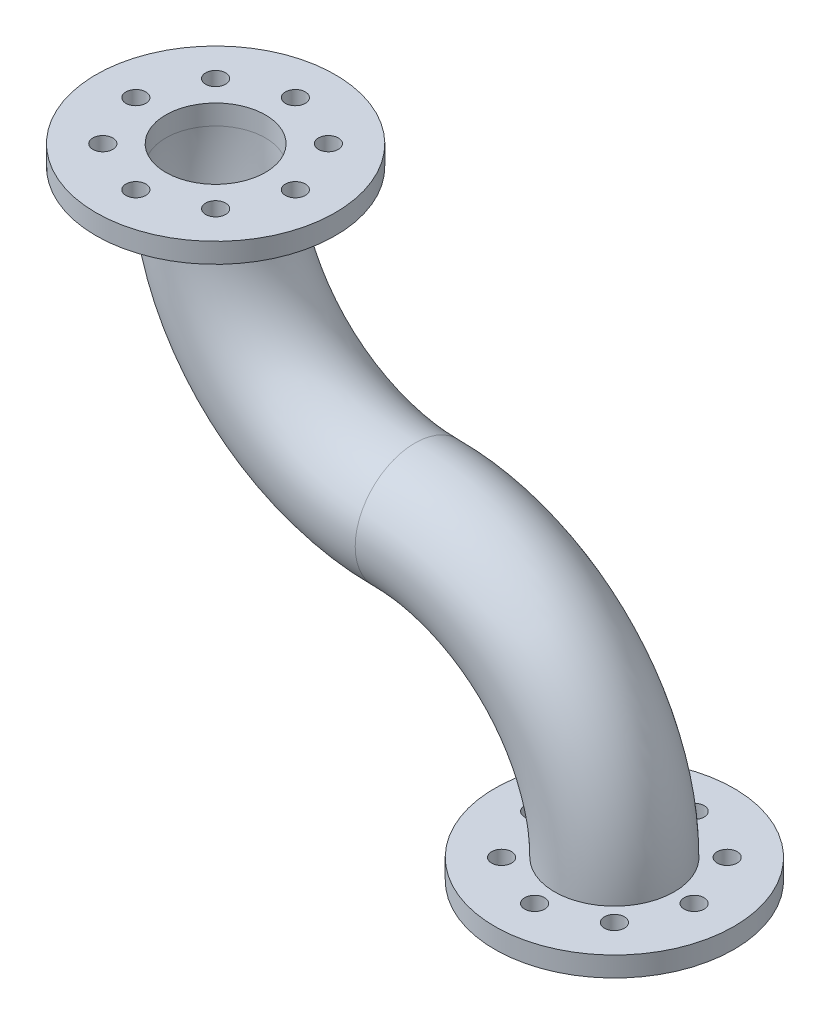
ISO-10303-21;
HEADER;
FILE_DESCRIPTION(('STEP AP214'),'2;1');
FILE_NAME('part.step','',(''),(''),'','','');
FILE_SCHEMA(('AUTOMOTIVE_DESIGN { 1 0 10303 214 1 1 1 1 }'));
ENDSEC;
DATA;
#1=APPLICATION_CONTEXT('core data for automotive mechanical design processes');
#2=APPLICATION_PROTOCOL_DEFINITION('international standard','automotive_design',2000,#1);
#3=PRODUCT_CONTEXT('',#1,'mechanical');
#4=PRODUCT('Part','Part','',(#3));
#5=PRODUCT_RELATED_PRODUCT_CATEGORY('part','',(#4));
#6=PRODUCT_DEFINITION_FORMATION('','',#4);
#7=PRODUCT_DEFINITION_CONTEXT('part definition',#1,'design');
#8=PRODUCT_DEFINITION('design','',#6,#7);
#9=PRODUCT_DEFINITION_SHAPE('','',#8);
#10=(LENGTH_UNIT() NAMED_UNIT(*) SI_UNIT(.MILLI.,.METRE.));
#11=(NAMED_UNIT(*) PLANE_ANGLE_UNIT() SI_UNIT($,.RADIAN.));
#12=(NAMED_UNIT(*) SI_UNIT($,.STERADIAN.) SOLID_ANGLE_UNIT());
#13=UNCERTAINTY_MEASURE_WITH_UNIT(LENGTH_MEASURE(1.E-05),#10,'distance_accuracy_value','');
#14=(GEOMETRIC_REPRESENTATION_CONTEXT(3) GLOBAL_UNCERTAINTY_ASSIGNED_CONTEXT((#13)) GLOBAL_UNIT_ASSIGNED_CONTEXT((#10,
#11,#12)) REPRESENTATION_CONTEXT('',''));
#15=CARTESIAN_POINT('',(0.,0.,0.));
#16=DIRECTION('',(0.,0.,1.));
#17=DIRECTION('',(1.,0.,0.));
#18=AXIS2_PLACEMENT_3D('',#15,#16,#17);
#19=CARTESIAN_POINT('',(1.74574168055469E-13,-100.,0.));
#20=DIRECTION('',(0.,0.,-1.));
#21=DIRECTION('',(-1.,0.,0.));
#22=AXIS2_PLACEMENT_3D('',#19,#20,#21);
#23=TOROIDAL_SURFACE('',#22,50.,15.);
#24=CARTESIAN_POINT('',(1.74574066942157E-13,-50.,0.));
#25=DIRECTION('',(-1.,0.,0.));
#26=DIRECTION('',(0.,0.,1.));
#27=AXIS2_PLACEMENT_3D('',#24,#25,#26);
#28=CIRCLE('',#27,15.);
#29=CARTESIAN_POINT('',(1.74574036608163E-13,-35.,0.));
#30=VERTEX_POINT('',#29);
#31=EDGE_CURVE('E36',#30,#30,#28,.T.);
#32=CARTESIAN_POINT('',(50.0000000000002,-99.9999999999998,0.));
#33=DIRECTION('',(0.,-1.,0.));
#34=DIRECTION('',(1.,0.,0.));
#35=AXIS2_PLACEMENT_3D('',#32,#33,#34);
#36=CIRCLE('',#35,15.);
#37=CARTESIAN_POINT('',(65.0000000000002,-99.9999999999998,0.));
#38=VERTEX_POINT('',#37);
#39=EDGE_CURVE('E61',#38,#38,#36,.T.);
#40=CARTESIAN_POINT('',(1.74574168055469E-13,-100.,0.));
#41=DIRECTION('',(0.,0.,-1.));
#42=DIRECTION('',(-1.,0.,0.));
#43=AXIS2_PLACEMENT_3D('',#40,#41,#42);
#44=CIRCLE('',#43,65.);
#45=EDGE_CURVE('',#30,#38,#44,.T.);
#46=ORIENTED_EDGE('',*,*,#31,.F.);
#47=ORIENTED_EDGE('',*,*,#39,.F.);
#48=ORIENTED_EDGE('',*,*,#45,.T.);
#49=ORIENTED_EDGE('',*,*,#45,.F.);
#50=EDGE_LOOP('',(#46,#48,#47,#49));
#51=FACE_BOUND('',#50,.T.);
#52=ADVANCED_FACE('F30',(#51),#23,.T.);
#53=CARTESIAN_POINT('',(1.74574168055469E-13,-100.,0.));
#54=DIRECTION('',(0.,0.,-1.));
#55=DIRECTION('',(-1.,0.,0.));
#56=AXIS2_PLACEMENT_3D('',#53,#54,#55);
#57=TOROIDAL_SURFACE('',#56,50.,12.5);
#58=CARTESIAN_POINT('',(1.74574066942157E-13,-50.,0.));
#59=DIRECTION('',(-1.,0.,0.));
#60=DIRECTION('',(0.,0.,1.));
#61=AXIS2_PLACEMENT_3D('',#58,#59,#60);
#62=CIRCLE('',#61,12.5);
#63=CARTESIAN_POINT('',(1.74574041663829E-13,-37.5,0.));
#64=VERTEX_POINT('',#63);
#65=EDGE_CURVE('E40',#64,#64,#62,.T.);
#66=CARTESIAN_POINT('',(50.0000000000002,-100.,0.));
#67=DIRECTION('',(0.,1.,0.));
#68=DIRECTION('',(0.,0.,1.));
#69=AXIS2_PLACEMENT_3D('',#66,#67,#68);
#70=CIRCLE('',#69,12.5);
#71=CARTESIAN_POINT('',(62.5000000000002,-100.,0.));
#72=VERTEX_POINT('',#71);
#73=EDGE_CURVE('E10',#72,#72,#70,.T.);
#74=CARTESIAN_POINT('',(1.74574168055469E-13,-100.,0.));
#75=DIRECTION('',(0.,0.,-1.));
#76=DIRECTION('',(-1.,0.,0.));
#77=AXIS2_PLACEMENT_3D('',#74,#75,#76);
#78=CIRCLE('',#77,62.5);
#79=EDGE_CURVE('',#64,#72,#78,.T.);
#80=ORIENTED_EDGE('',*,*,#65,.T.);
#81=ORIENTED_EDGE('',*,*,#73,.F.);
#82=ORIENTED_EDGE('',*,*,#79,.T.);
#83=ORIENTED_EDGE('',*,*,#79,.F.);
#84=EDGE_LOOP('',(#80,#82,#81,#83));
#85=FACE_BOUND('',#84,.T.);
#86=ADVANCED_FACE('F197',(#85),#57,.F.);
#87=CARTESIAN_POINT('',(0.,0.,0.));
#88=DIRECTION('',(0.,0.,-1.));
#89=DIRECTION('',(-1.,0.,0.));
#90=AXIS2_PLACEMENT_3D('',#87,#88,#89);
#91=TOROIDAL_SURFACE('',#90,50.,12.5);
#92=ORIENTED_EDGE('',*,*,#65,.F.);
#93=EDGE_LOOP('',(#92));
#94=FACE_BOUND('',#93,.T.);
#95=CARTESIAN_POINT('',(-50.,0.,0.));
#96=DIRECTION('',(0.,1.,0.));
#97=DIRECTION('',(0.,0.,1.));
#98=AXIS2_PLACEMENT_3D('',#95,#96,#97);
#99=CIRCLE('',#98,12.5);
#100=CARTESIAN_POINT('',(-50.,0.,12.5));
#101=VERTEX_POINT('',#100);
#102=EDGE_CURVE('E49',#101,#101,#99,.T.);
#103=ORIENTED_EDGE('',*,*,#102,.T.);
#104=EDGE_LOOP('',(#103));
#105=FACE_BOUND('',#104,.T.);
#106=ADVANCED_FACE('F202',(#94,#105),#91,.F.);
#107=CARTESIAN_POINT('',(0.,0.,0.));
#108=DIRECTION('',(0.,0.,-1.));
#109=DIRECTION('',(-1.,0.,0.));
#110=AXIS2_PLACEMENT_3D('',#107,#108,#109);
#111=TOROIDAL_SURFACE('',#110,50.,15.);
#112=ORIENTED_EDGE('',*,*,#31,.T.);
#113=EDGE_LOOP('',(#112));
#114=FACE_BOUND('',#113,.T.);
#115=CARTESIAN_POINT('',(-50.,0.,0.));
#116=DIRECTION('',(0.,1.,0.));
#117=DIRECTION('',(0.,0.,1.));
#118=AXIS2_PLACEMENT_3D('',#115,#116,#117);
#119=CIRCLE('',#118,15.);
#120=CARTESIAN_POINT('',(-50.,0.,15.));
#121=VERTEX_POINT('',#120);
#122=EDGE_CURVE('E44',#121,#121,#119,.T.);
#123=ORIENTED_EDGE('',*,*,#122,.F.);
#124=EDGE_LOOP('',(#123));
#125=FACE_BOUND('',#124,.T.);
#126=ADVANCED_FACE('F207',(#114,#125),#111,.T.);
#127=CARTESIAN_POINT('',(-50.,5.,0.));
#128=DIRECTION('',(0.,1.,0.));
#129=DIRECTION('',(0.,0.,1.));
#130=AXIS2_PLACEMENT_3D('',#127,#128,#129);
#131=PLANE('',#130);
#132=CARTESIAN_POINT('',(-64.1421356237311,5.,14.1421356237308));
#133=DIRECTION('',(0.,1.,0.));
#134=DIRECTION('',(0.707106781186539,0.,0.707106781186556));
#135=AXIS2_PLACEMENT_3D('',#132,#133,#134);
#136=CIRCLE('',#135,2.5);
#137=CARTESIAN_POINT('',(-62.3743686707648,5.,15.9099025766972));
#138=VERTEX_POINT('',#137);
#139=EDGE_CURVE('E118',#138,#138,#136,.T.);
#140=ORIENTED_EDGE('',*,*,#139,.F.);
#141=EDGE_LOOP('',(#140));
#142=FACE_BOUND('',#141,.T.);
#143=CARTESIAN_POINT('',(-50.0000000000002,5.,20.));
#144=DIRECTION('',(0.,1.,0.));
#145=DIRECTION('',(1.,0.,0.));
#146=AXIS2_PLACEMENT_3D('',#143,#144,#145);
#147=CIRCLE('',#146,2.5);
#148=CARTESIAN_POINT('',(-47.5000000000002,5.,20.));
#149=VERTEX_POINT('',#148);
#150=EDGE_CURVE('E112',#149,#149,#147,.T.);
#151=ORIENTED_EDGE('',*,*,#150,.F.);
#152=EDGE_LOOP('',(#151));
#153=FACE_BOUND('',#152,.T.);
#154=CARTESIAN_POINT('',(-35.8578643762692,5.,14.1421356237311));
#155=DIRECTION('',(0.,1.,0.));
#156=DIRECTION('',(0.707106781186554,0.,-0.707106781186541));
#157=AXIS2_PLACEMENT_3D('',#154,#155,#156);
#158=CIRCLE('',#157,2.5);
#159=CARTESIAN_POINT('',(-34.0900974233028,5.,12.3743686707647));
#160=VERTEX_POINT('',#159);
#161=EDGE_CURVE('E104',#160,#160,#158,.T.);
#162=ORIENTED_EDGE('',*,*,#161,.F.);
#163=EDGE_LOOP('',(#162));
#164=FACE_BOUND('',#163,.T.);
#165=CARTESIAN_POINT('',(-30.,5.,1.39659253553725E-13));
#166=DIRECTION('',(0.,1.,0.));
#167=DIRECTION('',(0.,0.,-1.));
#168=AXIS2_PLACEMENT_3D('',#165,#166,#167);
#169=CIRCLE('',#168,2.5);
#170=CARTESIAN_POINT('',(-30.,5.,-2.49999999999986));
#171=VERTEX_POINT('',#170);
#172=EDGE_CURVE('E95',#171,#171,#169,.T.);
#173=ORIENTED_EDGE('',*,*,#172,.F.);
#174=EDGE_LOOP('',(#173));
#175=FACE_BOUND('',#174,.T.);
#176=CARTESIAN_POINT('',(-35.857864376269,5.,-14.1421356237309));
#177=DIRECTION('',(0.,1.,0.));
#178=DIRECTION('',(-0.707106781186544,0.,-0.707106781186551));
#179=AXIS2_PLACEMENT_3D('',#176,#177,#178);
#180=CIRCLE('',#179,2.5);
#181=CARTESIAN_POINT('',(-37.6256313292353,5.,-15.9099025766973));
#182=VERTEX_POINT('',#181);
#183=EDGE_CURVE('E92',#182,#182,#180,.T.);
#184=ORIENTED_EDGE('',*,*,#183,.F.);
#185=EDGE_LOOP('',(#184));
#186=FACE_BOUND('',#185,.T.);
#187=CARTESIAN_POINT('',(-49.9999999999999,5.,-20.));
#188=DIRECTION('',(0.,1.,0.));
#189=DIRECTION('',(-1.,0.,0.));
#190=AXIS2_PLACEMENT_3D('',#187,#188,#189);
#191=CIRCLE('',#190,2.5);
#192=CARTESIAN_POINT('',(-52.4999999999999,5.,-20.));
#193=VERTEX_POINT('',#192);
#194=EDGE_CURVE('E88',#193,#193,#191,.T.);
#195=ORIENTED_EDGE('',*,*,#194,.F.);
#196=EDGE_LOOP('',(#195));
#197=FACE_BOUND('',#196,.T.);
#198=CARTESIAN_POINT('',(-64.1421356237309,5.,-14.142135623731));
#199=DIRECTION('',(0.,1.,0.));
#200=DIRECTION('',(-0.707106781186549,0.,0.707106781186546));
#201=AXIS2_PLACEMENT_3D('',#198,#199,#200);
#202=CIRCLE('',#201,2.5);
#203=CARTESIAN_POINT('',(-65.9099025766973,5.,-12.3743686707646));
#204=VERTEX_POINT('',#203);
#205=EDGE_CURVE('E82',#204,#204,#202,.T.);
#206=ORIENTED_EDGE('',*,*,#205,.F.);
#207=EDGE_LOOP('',(#206));
#208=FACE_BOUND('',#207,.T.);
#209=CARTESIAN_POINT('',(-70.,5.,0.));
#210=DIRECTION('',(0.,1.,0.));
#211=DIRECTION('',(0.,0.,1.));
#212=AXIS2_PLACEMENT_3D('',#209,#210,#211);
#213=CIRCLE('',#212,2.5);
#214=CARTESIAN_POINT('',(-70.,5.,2.5));
#215=VERTEX_POINT('',#214);
#216=EDGE_CURVE('E76',#215,#215,#213,.T.);
#217=ORIENTED_EDGE('',*,*,#216,.F.);
#218=EDGE_LOOP('',(#217));
#219=FACE_BOUND('',#218,.T.);
#220=CARTESIAN_POINT('',(-50.,5.,0.));
#221=DIRECTION('',(0.,1.,0.));
#222=DIRECTION('',(0.,0.,1.));
#223=AXIS2_PLACEMENT_3D('',#220,#221,#222);
#224=CIRCLE('',#223,30.);
#225=CARTESIAN_POINT('',(-50.,5.,30.));
#226=VERTEX_POINT('',#225);
#227=EDGE_CURVE('E52',#226,#226,#224,.T.);
#228=ORIENTED_EDGE('',*,*,#227,.T.);
#229=EDGE_LOOP('',(#228));
#230=FACE_BOUND('',#229,.T.);
#231=CARTESIAN_POINT('',(-50.,5.,0.));
#232=DIRECTION('',(0.,1.,0.));
#233=DIRECTION('',(0.,0.,1.));
#234=AXIS2_PLACEMENT_3D('',#231,#232,#233);
#235=CIRCLE('',#234,12.5);
#236=CARTESIAN_POINT('',(-50.,5.,12.5));
#237=VERTEX_POINT('',#236);
#238=EDGE_CURVE('E56',#237,#237,#235,.T.);
#239=ORIENTED_EDGE('',*,*,#238,.F.);
#240=EDGE_LOOP('',(#239));
#241=FACE_BOUND('',#240,.T.);
#242=ADVANCED_FACE('F213',(#142,#153,#164,#175,#186,#197,#208,#219,#230,#241),#131,.T.);
#243=CARTESIAN_POINT('',(-50.,0.,0.));
#244=DIRECTION('',(0.,1.,0.));
#245=DIRECTION('',(0.,0.,1.));
#246=AXIS2_PLACEMENT_3D('',#243,#244,#245);
#247=PLANE('',#246);
#248=CARTESIAN_POINT('',(-64.1421356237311,0.,14.1421356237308));
#249=DIRECTION('',(0.,1.,0.));
#250=DIRECTION('',(0.,0.,1.));
#251=AXIS2_PLACEMENT_3D('',#248,#249,#250);
#252=CIRCLE('',#251,2.5);
#253=CARTESIAN_POINT('',(-64.1421356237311,0.,16.6421356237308));
#254=VERTEX_POINT('',#253);
#255=EDGE_CURVE('E115',#254,#254,#252,.F.);
#256=ORIENTED_EDGE('',*,*,#255,.F.);
#257=EDGE_LOOP('',(#256));
#258=FACE_BOUND('',#257,.T.);
#259=CARTESIAN_POINT('',(-50.0000000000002,0.,20.));
#260=DIRECTION('',(0.,1.,0.));
#261=DIRECTION('',(0.,0.,1.));
#262=AXIS2_PLACEMENT_3D('',#259,#260,#261);
#263=CIRCLE('',#262,2.5);
#264=CARTESIAN_POINT('',(-50.0000000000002,0.,22.5));
#265=VERTEX_POINT('',#264);
#266=EDGE_CURVE('E107',#265,#265,#263,.F.);
#267=ORIENTED_EDGE('',*,*,#266,.F.);
#268=EDGE_LOOP('',(#267));
#269=FACE_BOUND('',#268,.T.);
#270=CARTESIAN_POINT('',(-35.8578643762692,0.,14.1421356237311));
#271=DIRECTION('',(0.,1.,0.));
#272=DIRECTION('',(0.,0.,1.));
#273=AXIS2_PLACEMENT_3D('',#270,#271,#272);
#274=CIRCLE('',#273,2.5);
#275=CARTESIAN_POINT('',(-35.8578643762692,0.,16.6421356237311));
#276=VERTEX_POINT('',#275);
#277=EDGE_CURVE('E103',#276,#276,#274,.F.);
#278=ORIENTED_EDGE('',*,*,#277,.F.);
#279=EDGE_LOOP('',(#278));
#280=FACE_BOUND('',#279,.T.);
#281=CARTESIAN_POINT('',(-30.,0.,1.39659253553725E-13));
#282=DIRECTION('',(0.,1.,0.));
#283=DIRECTION('',(0.,0.,1.));
#284=AXIS2_PLACEMENT_3D('',#281,#282,#283);
#285=CIRCLE('',#284,2.5);
#286=CARTESIAN_POINT('',(-30.,0.,2.50000000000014));
#287=VERTEX_POINT('',#286);
#288=EDGE_CURVE('E100',#287,#287,#285,.F.);
#289=ORIENTED_EDGE('',*,*,#288,.F.);
#290=EDGE_LOOP('',(#289));
#291=FACE_BOUND('',#290,.T.);
#292=CARTESIAN_POINT('',(-35.857864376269,0.,-14.1421356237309));
#293=DIRECTION('',(0.,1.,0.));
#294=DIRECTION('',(0.,0.,1.));
#295=AXIS2_PLACEMENT_3D('',#292,#293,#294);
#296=CIRCLE('',#295,2.5);
#297=CARTESIAN_POINT('',(-35.857864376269,0.,-11.6421356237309));
#298=VERTEX_POINT('',#297);
#299=EDGE_CURVE('E91',#298,#298,#296,.F.);
#300=ORIENTED_EDGE('',*,*,#299,.F.);
#301=EDGE_LOOP('',(#300));
#302=FACE_BOUND('',#301,.T.);
#303=CARTESIAN_POINT('',(-49.9999999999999,0.,-20.));
#304=DIRECTION('',(0.,1.,0.));
#305=DIRECTION('',(0.,0.,1.));
#306=AXIS2_PLACEMENT_3D('',#303,#304,#305);
#307=CIRCLE('',#306,2.5);
#308=CARTESIAN_POINT('',(-49.9999999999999,0.,-17.5));
#309=VERTEX_POINT('',#308);
#310=EDGE_CURVE('E85',#309,#309,#307,.F.);
#311=ORIENTED_EDGE('',*,*,#310,.F.);
#312=EDGE_LOOP('',(#311));
#313=FACE_BOUND('',#312,.T.);
#314=CARTESIAN_POINT('',(-64.1421356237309,0.,-14.142135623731));
#315=DIRECTION('',(0.,1.,0.));
#316=DIRECTION('',(0.,0.,1.));
#317=AXIS2_PLACEMENT_3D('',#314,#315,#316);
#318=CIRCLE('',#317,2.5);
#319=CARTESIAN_POINT('',(-64.1421356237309,0.,-11.642135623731));
#320=VERTEX_POINT('',#319);
#321=EDGE_CURVE('E79',#320,#320,#318,.F.);
#322=ORIENTED_EDGE('',*,*,#321,.F.);
#323=EDGE_LOOP('',(#322));
#324=FACE_BOUND('',#323,.T.);
#325=CARTESIAN_POINT('',(-70.,0.,0.));
#326=DIRECTION('',(0.,1.,0.));
#327=DIRECTION('',(0.,0.,1.));
#328=AXIS2_PLACEMENT_3D('',#325,#326,#327);
#329=CIRCLE('',#328,2.5);
#330=CARTESIAN_POINT('',(-70.,0.,2.5));
#331=VERTEX_POINT('',#330);
#332=EDGE_CURVE('E73',#331,#331,#329,.F.);
#333=ORIENTED_EDGE('',*,*,#332,.F.);
#334=EDGE_LOOP('',(#333));
#335=FACE_BOUND('',#334,.T.);
#336=ORIENTED_EDGE('',*,*,#122,.T.);
#337=EDGE_LOOP('',(#336));
#338=FACE_BOUND('',#337,.T.);
#339=CARTESIAN_POINT('',(-50.,0.,0.));
#340=DIRECTION('',(0.,1.,0.));
#341=DIRECTION('',(0.,0.,1.));
#342=AXIS2_PLACEMENT_3D('',#339,#340,#341);
#343=CIRCLE('',#342,30.);
#344=CARTESIAN_POINT('',(-50.,0.,30.));
#345=VERTEX_POINT('',#344);
#346=EDGE_CURVE('E53',#345,#345,#343,.T.);
#347=ORIENTED_EDGE('',*,*,#346,.F.);
#348=EDGE_LOOP('',(#347));
#349=FACE_BOUND('',#348,.T.);
#350=ADVANCED_FACE('F218',(#258,#269,#280,#291,#302,#313,#324,#335,#338,#349),#247,.F.);
#351=CARTESIAN_POINT('',(-50.,5.,0.));
#352=DIRECTION('',(0.,-1.,0.));
#353=DIRECTION('',(0.,0.,-1.));
#354=AXIS2_PLACEMENT_3D('',#351,#352,#353);
#355=CYLINDRICAL_SURFACE('',#354,30.);
#356=ORIENTED_EDGE('',*,*,#227,.F.);
#357=EDGE_LOOP('',(#356));
#358=FACE_BOUND('',#357,.T.);
#359=ORIENTED_EDGE('',*,*,#346,.T.);
#360=EDGE_LOOP('',(#359));
#361=FACE_BOUND('',#360,.T.);
#362=ADVANCED_FACE('F215',(#358,#361),#355,.T.);
#363=CARTESIAN_POINT('',(-50.,5.,0.));
#364=DIRECTION('',(0.,-1.,0.));
#365=DIRECTION('',(0.,0.,-1.));
#366=AXIS2_PLACEMENT_3D('',#363,#364,#365);
#367=CYLINDRICAL_SURFACE('',#366,12.5);
#368=ORIENTED_EDGE('',*,*,#238,.T.);
#369=EDGE_LOOP('',(#368));
#370=FACE_BOUND('',#369,.T.);
#371=ORIENTED_EDGE('',*,*,#102,.F.);
#372=EDGE_LOOP('',(#371));
#373=FACE_BOUND('',#372,.T.);
#374=ADVANCED_FACE('F176',(#370,#373),#367,.F.);
#375=CARTESIAN_POINT('',(50.0000000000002,-99.9999999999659,0.));
#376=DIRECTION('',(0.,-1.,0.));
#377=DIRECTION('',(1.,0.,0.));
#378=AXIS2_PLACEMENT_3D('',#375,#376,#377);
#379=PLANE('',#378);
#380=CARTESIAN_POINT('',(64.1421356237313,-100.000000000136,14.1421356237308));
#381=DIRECTION('',(0.,1.,0.));
#382=DIRECTION('',(-0.707106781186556,0.,-0.707106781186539));
#383=AXIS2_PLACEMENT_3D('',#380,#381,#382);
#384=CIRCLE('',#383,2.50000000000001);
#385=CARTESIAN_POINT('',(62.3743686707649,-100.000000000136,12.3743686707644));
#386=VERTEX_POINT('',#385);
#387=EDGE_CURVE('E161',#386,#386,#384,.T.);
#388=ORIENTED_EDGE('',*,*,#387,.F.);
#389=EDGE_LOOP('',(#388));
#390=FACE_BOUND('',#389,.T.);
#391=CARTESIAN_POINT('',(50.0000000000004,-100.000000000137,20.));
#392=DIRECTION('',(0.,1.,0.));
#393=DIRECTION('',(0.,0.,-1.));
#394=AXIS2_PLACEMENT_3D('',#391,#392,#393);
#395=CIRCLE('',#394,2.50000000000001);
#396=CARTESIAN_POINT('',(47.5000000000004,-100.000000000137,20.));
#397=VERTEX_POINT('',#396);
#398=EDGE_CURVE('E155',#397,#397,#395,.T.);
#399=ORIENTED_EDGE('',*,*,#398,.F.);
#400=EDGE_LOOP('',(#399));
#401=FACE_BOUND('',#400,.T.);
#402=CARTESIAN_POINT('',(35.8578643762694,-100.000000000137,14.1421356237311));
#403=DIRECTION('',(0.,1.,0.));
#404=DIRECTION('',(0.707106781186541,0.,-0.707106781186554));
#405=AXIS2_PLACEMENT_3D('',#402,#403,#404);
#406=CIRCLE('',#405,2.50000000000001);
#407=CARTESIAN_POINT('',(37.6256313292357,-100.000000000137,12.3743686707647));
#408=VERTEX_POINT('',#407);
#409=EDGE_CURVE('E149',#408,#408,#406,.T.);
#410=ORIENTED_EDGE('',*,*,#409,.F.);
#411=EDGE_LOOP('',(#410));
#412=FACE_BOUND('',#411,.T.);
#413=CARTESIAN_POINT('',(30.0000000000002,-100.000000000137,1.39659253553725E-13));
#414=DIRECTION('',(0.,1.,0.));
#415=DIRECTION('',(1.,0.,0.));
#416=AXIS2_PLACEMENT_3D('',#413,#414,#415);
#417=CIRCLE('',#416,2.50000000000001);
#418=CARTESIAN_POINT('',(32.5000000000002,-100.000000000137,1.2220184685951E-13));
#419=VERTEX_POINT('',#418);
#420=EDGE_CURVE('E143',#419,#419,#417,.T.);
#421=ORIENTED_EDGE('',*,*,#420,.F.);
#422=EDGE_LOOP('',(#421));
#423=FACE_BOUND('',#422,.T.);
#424=CARTESIAN_POINT('',(35.8578643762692,-100.000000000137,-14.1421356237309));
#425=DIRECTION('',(0.,1.,0.));
#426=DIRECTION('',(0.707106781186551,0.,0.707106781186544));
#427=AXIS2_PLACEMENT_3D('',#424,#425,#426);
#428=CIRCLE('',#427,2.50000000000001);
#429=CARTESIAN_POINT('',(37.6256313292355,-100.000000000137,-12.3743686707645));
#430=VERTEX_POINT('',#429);
#431=EDGE_CURVE('E137',#430,#430,#428,.T.);
#432=ORIENTED_EDGE('',*,*,#431,.F.);
#433=EDGE_LOOP('',(#432));
#434=FACE_BOUND('',#433,.T.);
#435=CARTESIAN_POINT('',(50.0000000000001,-100.000000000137,-20.));
#436=DIRECTION('',(0.,1.,0.));
#437=DIRECTION('',(0.,0.,1.));
#438=AXIS2_PLACEMENT_3D('',#435,#436,#437);
#439=CIRCLE('',#438,2.50000000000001);
#440=CARTESIAN_POINT('',(47.5000000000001,-100.000000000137,-20.));
#441=VERTEX_POINT('',#440);
#442=EDGE_CURVE('E131',#441,#441,#439,.T.);
#443=ORIENTED_EDGE('',*,*,#442,.F.);
#444=EDGE_LOOP('',(#443));
#445=FACE_BOUND('',#444,.T.);
#446=CARTESIAN_POINT('',(64.1421356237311,-100.000000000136,-14.142135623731));
#447=DIRECTION('',(0.,1.,0.));
#448=DIRECTION('',(-0.707106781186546,0.,0.707106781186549));
#449=AXIS2_PLACEMENT_3D('',#446,#447,#448);
#450=CIRCLE('',#449,2.50000000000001);
#451=CARTESIAN_POINT('',(62.3743686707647,-100.000000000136,-12.3743686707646));
#452=VERTEX_POINT('',#451);
#453=EDGE_CURVE('E125',#452,#452,#450,.T.);
#454=ORIENTED_EDGE('',*,*,#453,.F.);
#455=EDGE_LOOP('',(#454));
#456=FACE_BOUND('',#455,.T.);
#457=CARTESIAN_POINT('',(70.0000000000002,-100.000000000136,0.));
#458=DIRECTION('',(0.,1.,0.));
#459=DIRECTION('',(-1.,0.,0.));
#460=AXIS2_PLACEMENT_3D('',#457,#458,#459);
#461=CIRCLE('',#460,2.50000000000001);
#462=CARTESIAN_POINT('',(67.5000000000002,-100.000000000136,0.));
#463=VERTEX_POINT('',#462);
#464=EDGE_CURVE('E121',#463,#463,#461,.T.);
#465=ORIENTED_EDGE('',*,*,#464,.F.);
#466=EDGE_LOOP('',(#465));
#467=FACE_BOUND('',#466,.T.);
#468=CARTESIAN_POINT('',(50.0000000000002,-99.9999999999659,0.));
#469=DIRECTION('',(0.,-1.,0.));
#470=DIRECTION('',(1.,0.,0.));
#471=AXIS2_PLACEMENT_3D('',#468,#469,#470);
#472=CIRCLE('',#471,30.);
#473=CARTESIAN_POINT('',(80.0000000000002,-99.9999999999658,0.));
#474=VERTEX_POINT('',#473);
#475=EDGE_CURVE('E65',#474,#474,#472,.T.);
#476=ORIENTED_EDGE('',*,*,#475,.F.);
#477=EDGE_LOOP('',(#476));
#478=FACE_BOUND('',#477,.T.);
#479=ORIENTED_EDGE('',*,*,#39,.T.);
#480=EDGE_LOOP('',(#479));
#481=FACE_BOUND('',#480,.T.);
#482=ADVANCED_FACE('F172',(#390,#401,#412,#423,#434,#445,#456,#467,#478,#481),#379,.F.);
#483=CARTESIAN_POINT('',(50.0000000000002,-104.999999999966,0.));
#484=DIRECTION('',(0.,-1.,0.));
#485=DIRECTION('',(1.,0.,0.));
#486=AXIS2_PLACEMENT_3D('',#483,#484,#485);
#487=PLANE('',#486);
#488=CARTESIAN_POINT('',(64.1421356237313,-104.999999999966,14.1421356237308));
#489=DIRECTION('',(0.,-1.,0.));
#490=DIRECTION('',(1.,0.,0.));
#491=AXIS2_PLACEMENT_3D('',#488,#489,#490);
#492=CIRCLE('',#491,2.50000000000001);
#493=CARTESIAN_POINT('',(66.6421356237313,-104.999999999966,14.1421356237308));
#494=VERTEX_POINT('',#493);
#495=EDGE_CURVE('E164',#494,#494,#492,.F.);
#496=ORIENTED_EDGE('',*,*,#495,.T.);
#497=EDGE_LOOP('',(#496));
#498=FACE_BOUND('',#497,.T.);
#499=CARTESIAN_POINT('',(50.0000000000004,-104.999999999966,20.));
#500=DIRECTION('',(0.,-1.,0.));
#501=DIRECTION('',(1.,0.,0.));
#502=AXIS2_PLACEMENT_3D('',#499,#500,#501);
#503=CIRCLE('',#502,2.50000000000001);
#504=CARTESIAN_POINT('',(47.5000000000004,-104.999999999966,20.));
#505=VERTEX_POINT('',#504);
#506=EDGE_CURVE('E158',#505,#505,#503,.F.);
#507=ORIENTED_EDGE('',*,*,#506,.T.);
#508=EDGE_LOOP('',(#507));
#509=FACE_BOUND('',#508,.T.);
#510=CARTESIAN_POINT('',(35.8578643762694,-104.999999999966,14.1421356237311));
#511=DIRECTION('',(0.,-1.,0.));
#512=DIRECTION('',(1.,0.,0.));
#513=AXIS2_PLACEMENT_3D('',#510,#511,#512);
#514=CIRCLE('',#513,2.50000000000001);
#515=CARTESIAN_POINT('',(38.3578643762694,-104.999999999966,14.1421356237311));
#516=VERTEX_POINT('',#515);
#517=EDGE_CURVE('E152',#516,#516,#514,.F.);
#518=ORIENTED_EDGE('',*,*,#517,.T.);
#519=EDGE_LOOP('',(#518));
#520=FACE_BOUND('',#519,.T.);
#521=CARTESIAN_POINT('',(30.0000000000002,-104.999999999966,1.39659253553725E-13));
#522=DIRECTION('',(0.,-1.,0.));
#523=DIRECTION('',(1.,0.,0.));
#524=AXIS2_PLACEMENT_3D('',#521,#522,#523);
#525=CIRCLE('',#524,2.50000000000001);
#526=CARTESIAN_POINT('',(32.5000000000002,-104.999999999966,1.39659253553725E-13));
#527=VERTEX_POINT('',#526);
#528=EDGE_CURVE('E146',#527,#527,#525,.F.);
#529=ORIENTED_EDGE('',*,*,#528,.T.);
#530=EDGE_LOOP('',(#529));
#531=FACE_BOUND('',#530,.T.);
#532=CARTESIAN_POINT('',(35.8578643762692,-104.999999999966,-14.1421356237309));
#533=DIRECTION('',(0.,-1.,0.));
#534=DIRECTION('',(1.,0.,0.));
#535=AXIS2_PLACEMENT_3D('',#532,#533,#534);
#536=CIRCLE('',#535,2.50000000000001);
#537=CARTESIAN_POINT('',(38.3578643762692,-104.999999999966,-14.1421356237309));
#538=VERTEX_POINT('',#537);
#539=EDGE_CURVE('E140',#538,#538,#536,.F.);
#540=ORIENTED_EDGE('',*,*,#539,.T.);
#541=EDGE_LOOP('',(#540));
#542=FACE_BOUND('',#541,.T.);
#543=CARTESIAN_POINT('',(50.0000000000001,-104.999999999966,-20.));
#544=DIRECTION('',(0.,-1.,0.));
#545=DIRECTION('',(1.,0.,0.));
#546=AXIS2_PLACEMENT_3D('',#543,#544,#545);
#547=CIRCLE('',#546,2.50000000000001);
#548=CARTESIAN_POINT('',(47.5000000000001,-104.999999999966,-20.));
#549=VERTEX_POINT('',#548);
#550=EDGE_CURVE('E134',#549,#549,#547,.F.);
#551=ORIENTED_EDGE('',*,*,#550,.T.);
#552=EDGE_LOOP('',(#551));
#553=FACE_BOUND('',#552,.T.);
#554=CARTESIAN_POINT('',(64.1421356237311,-104.999999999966,-14.142135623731));
#555=DIRECTION('',(0.,-1.,0.));
#556=DIRECTION('',(1.,0.,0.));
#557=AXIS2_PLACEMENT_3D('',#554,#555,#556);
#558=CIRCLE('',#557,2.50000000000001);
#559=CARTESIAN_POINT('',(66.6421356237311,-104.999999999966,-14.142135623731));
#560=VERTEX_POINT('',#559);
#561=EDGE_CURVE('E128',#560,#560,#558,.F.);
#562=ORIENTED_EDGE('',*,*,#561,.T.);
#563=EDGE_LOOP('',(#562));
#564=FACE_BOUND('',#563,.T.);
#565=CARTESIAN_POINT('',(70.0000000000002,-104.999999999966,0.));
#566=DIRECTION('',(0.,-1.,0.));
#567=DIRECTION('',(1.,0.,0.));
#568=AXIS2_PLACEMENT_3D('',#565,#566,#567);
#569=CIRCLE('',#568,2.50000000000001);
#570=CARTESIAN_POINT('',(72.5000000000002,-104.999999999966,0.));
#571=VERTEX_POINT('',#570);
#572=EDGE_CURVE('E122',#571,#571,#569,.F.);
#573=ORIENTED_EDGE('',*,*,#572,.T.);
#574=EDGE_LOOP('',(#573));
#575=FACE_BOUND('',#574,.T.);
#576=CARTESIAN_POINT('',(50.0000000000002,-104.999999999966,0.));
#577=DIRECTION('',(0.,-1.,0.));
#578=DIRECTION('',(1.,0.,0.));
#579=AXIS2_PLACEMENT_3D('',#576,#577,#578);
#580=CIRCLE('',#579,30.);
#581=CARTESIAN_POINT('',(80.0000000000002,-104.999999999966,0.));
#582=VERTEX_POINT('',#581);
#583=EDGE_CURVE('E64',#582,#582,#580,.T.);
#584=ORIENTED_EDGE('',*,*,#583,.T.);
#585=EDGE_LOOP('',(#584));
#586=FACE_BOUND('',#585,.T.);
#587=CARTESIAN_POINT('',(50.0000000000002,-104.999999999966,0.));
#588=DIRECTION('',(0.,-1.,0.));
#589=DIRECTION('',(1.,0.,0.));
#590=AXIS2_PLACEMENT_3D('',#587,#588,#589);
#591=CIRCLE('',#590,12.5);
#592=CARTESIAN_POINT('',(62.5000000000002,-104.999999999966,0.));
#593=VERTEX_POINT('',#592);
#594=EDGE_CURVE('E68',#593,#593,#591,.T.);
#595=ORIENTED_EDGE('',*,*,#594,.F.);
#596=EDGE_LOOP('',(#595));
#597=FACE_BOUND('',#596,.T.);
#598=ADVANCED_FACE('F175',(#498,#509,#520,#531,#542,#553,#564,#575,#586,#597),#487,.T.);
#599=CARTESIAN_POINT('',(50.0000000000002,-104.999999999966,0.));
#600=DIRECTION('',(0.,1.,0.));
#601=DIRECTION('',(-1.,0.,0.));
#602=AXIS2_PLACEMENT_3D('',#599,#600,#601);
#603=CYLINDRICAL_SURFACE('',#602,30.);
#604=ORIENTED_EDGE('',*,*,#583,.F.);
#605=EDGE_LOOP('',(#604));
#606=FACE_BOUND('',#605,.T.);
#607=ORIENTED_EDGE('',*,*,#475,.T.);
#608=EDGE_LOOP('',(#607));
#609=FACE_BOUND('',#608,.T.);
#610=ADVANCED_FACE('F229',(#606,#609),#603,.T.);
#611=CARTESIAN_POINT('',(50.0000000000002,-104.999999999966,0.));
#612=DIRECTION('',(0.,1.,0.));
#613=DIRECTION('',(-1.,0.,0.));
#614=AXIS2_PLACEMENT_3D('',#611,#612,#613);
#615=CYLINDRICAL_SURFACE('',#614,12.5);
#616=ORIENTED_EDGE('',*,*,#594,.T.);
#617=EDGE_LOOP('',(#616));
#618=FACE_BOUND('',#617,.T.);
#619=ORIENTED_EDGE('',*,*,#73,.T.);
#620=EDGE_LOOP('',(#619));
#621=FACE_BOUND('',#620,.T.);
#622=ADVANCED_FACE('F231',(#618,#621),#615,.F.);
#623=CARTESIAN_POINT('',(-70.,-105.000999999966,0.));
#624=DIRECTION('',(0.,1.,0.));
#625=DIRECTION('',(0.,0.,1.));
#626=AXIS2_PLACEMENT_3D('',#623,#624,#625);
#627=CYLINDRICAL_SURFACE('',#626,2.5);
#628=ORIENTED_EDGE('',*,*,#216,.T.);
#629=EDGE_LOOP('',(#628));
#630=FACE_BOUND('',#629,.T.);
#631=ORIENTED_EDGE('',*,*,#332,.T.);
#632=EDGE_LOOP('',(#631));
#633=FACE_BOUND('',#632,.T.);
#634=ADVANCED_FACE('F239',(#630,#633),#627,.F.);
#635=CARTESIAN_POINT('',(-64.1421356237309,-105.000999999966,-14.142135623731));
#636=DIRECTION('',(0.,1.,0.));
#637=DIRECTION('',(0.,0.,1.));
#638=AXIS2_PLACEMENT_3D('',#635,#636,#637);
#639=CYLINDRICAL_SURFACE('',#638,2.5);
#640=ORIENTED_EDGE('',*,*,#205,.T.);
#641=EDGE_LOOP('',(#640));
#642=FACE_BOUND('',#641,.T.);
#643=ORIENTED_EDGE('',*,*,#321,.T.);
#644=EDGE_LOOP('',(#643));
#645=FACE_BOUND('',#644,.T.);
#646=ADVANCED_FACE('F243',(#642,#645),#639,.F.);
#647=CARTESIAN_POINT('',(-49.9999999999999,-105.000999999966,-20.));
#648=DIRECTION('',(0.,1.,0.));
#649=DIRECTION('',(0.,0.,1.));
#650=AXIS2_PLACEMENT_3D('',#647,#648,#649);
#651=CYLINDRICAL_SURFACE('',#650,2.5);
#652=ORIENTED_EDGE('',*,*,#194,.T.);
#653=EDGE_LOOP('',(#652));
#654=FACE_BOUND('',#653,.T.);
#655=ORIENTED_EDGE('',*,*,#310,.T.);
#656=EDGE_LOOP('',(#655));
#657=FACE_BOUND('',#656,.T.);
#658=ADVANCED_FACE('F247',(#654,#657),#651,.F.);
#659=CARTESIAN_POINT('',(-35.857864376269,-105.000999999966,-14.1421356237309));
#660=DIRECTION('',(0.,1.,0.));
#661=DIRECTION('',(0.,0.,1.));
#662=AXIS2_PLACEMENT_3D('',#659,#660,#661);
#663=CYLINDRICAL_SURFACE('',#662,2.5);
#664=ORIENTED_EDGE('',*,*,#183,.T.);
#665=EDGE_LOOP('',(#664));
#666=FACE_BOUND('',#665,.T.);
#667=ORIENTED_EDGE('',*,*,#299,.T.);
#668=EDGE_LOOP('',(#667));
#669=FACE_BOUND('',#668,.T.);
#670=ADVANCED_FACE('F251',(#666,#669),#663,.F.);
#671=CARTESIAN_POINT('',(-30.,-105.000999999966,1.39659253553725E-13));
#672=DIRECTION('',(0.,1.,0.));
#673=DIRECTION('',(0.,0.,1.));
#674=AXIS2_PLACEMENT_3D('',#671,#672,#673);
#675=CYLINDRICAL_SURFACE('',#674,2.5);
#676=ORIENTED_EDGE('',*,*,#172,.T.);
#677=EDGE_LOOP('',(#676));
#678=FACE_BOUND('',#677,.T.);
#679=ORIENTED_EDGE('',*,*,#288,.T.);
#680=EDGE_LOOP('',(#679));
#681=FACE_BOUND('',#680,.T.);
#682=ADVANCED_FACE('F255',(#678,#681),#675,.F.);
#683=CARTESIAN_POINT('',(-35.8578643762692,-105.000999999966,14.1421356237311));
#684=DIRECTION('',(0.,1.,0.));
#685=DIRECTION('',(0.,0.,1.));
#686=AXIS2_PLACEMENT_3D('',#683,#684,#685);
#687=CYLINDRICAL_SURFACE('',#686,2.5);
#688=ORIENTED_EDGE('',*,*,#161,.T.);
#689=EDGE_LOOP('',(#688));
#690=FACE_BOUND('',#689,.T.);
#691=ORIENTED_EDGE('',*,*,#277,.T.);
#692=EDGE_LOOP('',(#691));
#693=FACE_BOUND('',#692,.T.);
#694=ADVANCED_FACE('F259',(#690,#693),#687,.F.);
#695=CARTESIAN_POINT('',(-50.0000000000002,-105.000999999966,20.));
#696=DIRECTION('',(0.,1.,0.));
#697=DIRECTION('',(0.,0.,1.));
#698=AXIS2_PLACEMENT_3D('',#695,#696,#697);
#699=CYLINDRICAL_SURFACE('',#698,2.5);
#700=ORIENTED_EDGE('',*,*,#150,.T.);
#701=EDGE_LOOP('',(#700));
#702=FACE_BOUND('',#701,.T.);
#703=ORIENTED_EDGE('',*,*,#266,.T.);
#704=EDGE_LOOP('',(#703));
#705=FACE_BOUND('',#704,.T.);
#706=ADVANCED_FACE('F263',(#702,#705),#699,.F.);
#707=CARTESIAN_POINT('',(-64.1421356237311,-105.000999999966,14.1421356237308));
#708=DIRECTION('',(0.,1.,0.));
#709=DIRECTION('',(0.,0.,1.));
#710=AXIS2_PLACEMENT_3D('',#707,#708,#709);
#711=CYLINDRICAL_SURFACE('',#710,2.5);
#712=ORIENTED_EDGE('',*,*,#139,.T.);
#713=EDGE_LOOP('',(#712));
#714=FACE_BOUND('',#713,.T.);
#715=ORIENTED_EDGE('',*,*,#255,.T.);
#716=EDGE_LOOP('',(#715));
#717=FACE_BOUND('',#716,.T.);
#718=ADVANCED_FACE('F267',(#714,#717),#711,.F.);
#719=CARTESIAN_POINT('',(70.0000000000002,-105.000999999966,0.));
#720=DIRECTION('',(0.,1.,0.));
#721=DIRECTION('',(-1.,0.,0.));
#722=AXIS2_PLACEMENT_3D('',#719,#720,#721);
#723=CYLINDRICAL_SURFACE('',#722,2.50000000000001);
#724=ORIENTED_EDGE('',*,*,#572,.F.);
#725=EDGE_LOOP('',(#724));
#726=FACE_BOUND('',#725,.T.);
#727=ORIENTED_EDGE('',*,*,#464,.T.);
#728=EDGE_LOOP('',(#727));
#729=FACE_BOUND('',#728,.T.);
#730=ADVANCED_FACE('F271',(#726,#729),#723,.F.);
#731=CARTESIAN_POINT('',(64.1421356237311,-105.000999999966,-14.142135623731));
#732=DIRECTION('',(0.,1.,0.));
#733=DIRECTION('',(-1.,0.,0.));
#734=AXIS2_PLACEMENT_3D('',#731,#732,#733);
#735=CYLINDRICAL_SURFACE('',#734,2.50000000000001);
#736=ORIENTED_EDGE('',*,*,#561,.F.);
#737=EDGE_LOOP('',(#736));
#738=FACE_BOUND('',#737,.T.);
#739=ORIENTED_EDGE('',*,*,#453,.T.);
#740=EDGE_LOOP('',(#739));
#741=FACE_BOUND('',#740,.T.);
#742=ADVANCED_FACE('F275',(#738,#741),#735,.F.);
#743=CARTESIAN_POINT('',(50.0000000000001,-105.000999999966,-20.));
#744=DIRECTION('',(0.,1.,0.));
#745=DIRECTION('',(-1.,0.,0.));
#746=AXIS2_PLACEMENT_3D('',#743,#744,#745);
#747=CYLINDRICAL_SURFACE('',#746,2.50000000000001);
#748=CARTESIAN_POINT('',(47.5000000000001,-104.999999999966,-20.));
#749=CARTESIAN_POINT('',(47.5000000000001,-104.947916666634,-20.));
#750=CARTESIAN_POINT('',(47.5000000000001,-104.895833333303,-20.));
#751=CARTESIAN_POINT('',(47.5000000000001,-104.79166666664,-20.));
#752=CARTESIAN_POINT('',(47.5000000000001,-104.739583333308,-20.));
#753=CARTESIAN_POINT('',(47.5000000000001,-104.635416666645,-20.));
#754=CARTESIAN_POINT('',(47.5000000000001,-104.583333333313,-20.));
#755=CARTESIAN_POINT('',(47.5000000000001,-104.47916666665,-20.));
#756=CARTESIAN_POINT('',(47.5000000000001,-104.427083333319,-20.));
#757=CARTESIAN_POINT('',(47.5000000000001,-104.322916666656,-20.));
#758=CARTESIAN_POINT('',(47.5000000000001,-104.270833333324,-20.));
#759=CARTESIAN_POINT('',(47.5000000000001,-104.166666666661,-20.));
#760=CARTESIAN_POINT('',(47.5000000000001,-104.114583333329,-20.));
#761=CARTESIAN_POINT('',(47.5000000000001,-104.010416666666,-20.));
#762=CARTESIAN_POINT('',(47.5000000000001,-103.958333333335,-20.));
#763=CARTESIAN_POINT('',(47.5000000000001,-103.854166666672,-20.));
#764=CARTESIAN_POINT('',(47.5000000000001,-103.80208333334,-20.));
#765=CARTESIAN_POINT('',(47.5000000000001,-103.697916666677,-20.));
#766=CARTESIAN_POINT('',(47.5000000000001,-103.645833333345,-20.));
#767=CARTESIAN_POINT('',(47.5000000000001,-103.541666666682,-20.));
#768=CARTESIAN_POINT('',(47.5000000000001,-103.489583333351,-20.));
#769=CARTESIAN_POINT('',(47.5000000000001,-103.385416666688,-20.));
#770=CARTESIAN_POINT('',(47.5000000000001,-103.333333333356,-20.));
#771=CARTESIAN_POINT('',(47.5000000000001,-103.229166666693,-20.));
#772=CARTESIAN_POINT('',(47.5000000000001,-103.177083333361,-20.));
#773=CARTESIAN_POINT('',(47.5000000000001,-103.072916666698,-20.));
#774=CARTESIAN_POINT('',(47.5000000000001,-103.020833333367,-20.));
#775=CARTESIAN_POINT('',(47.5000000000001,-102.916666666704,-20.));
#776=CARTESIAN_POINT('',(47.5000000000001,-102.864583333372,-20.));
#777=CARTESIAN_POINT('',(47.5000000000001,-102.760416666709,-20.));
#778=CARTESIAN_POINT('',(47.5000000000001,-102.708333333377,-20.));
#779=CARTESIAN_POINT('',(47.5000000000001,-102.604166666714,-20.));
#780=CARTESIAN_POINT('',(47.5000000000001,-102.552083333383,-20.));
#781=CARTESIAN_POINT('',(47.5000000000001,-102.44791666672,-20.));
#782=CARTESIAN_POINT('',(47.5000000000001,-102.395833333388,-20.));
#783=CARTESIAN_POINT('',(47.5000000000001,-102.291666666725,-20.));
#784=CARTESIAN_POINT('',(47.5000000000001,-102.239583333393,-20.));
#785=CARTESIAN_POINT('',(47.5000000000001,-102.13541666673,-20.));
#786=CARTESIAN_POINT('',(47.5000000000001,-102.083333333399,-20.));
#787=CARTESIAN_POINT('',(47.5000000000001,-101.979166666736,-20.));
#788=CARTESIAN_POINT('',(47.5000000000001,-101.927083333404,-20.));
#789=CARTESIAN_POINT('',(47.5000000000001,-101.822916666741,-20.));
#790=CARTESIAN_POINT('',(47.5000000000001,-101.770833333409,-20.));
#791=CARTESIAN_POINT('',(47.5000000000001,-101.666666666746,-20.));
#792=CARTESIAN_POINT('',(47.5000000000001,-101.614583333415,-20.));
#793=CARTESIAN_POINT('',(47.5000000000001,-101.510416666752,-20.));
#794=CARTESIAN_POINT('',(47.5000000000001,-101.45833333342,-20.));
#795=CARTESIAN_POINT('',(47.5000000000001,-101.354166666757,-20.));
#796=CARTESIAN_POINT('',(47.5000000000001,-101.302083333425,-20.));
#797=CARTESIAN_POINT('',(47.5000000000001,-101.197916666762,-20.));
#798=CARTESIAN_POINT('',(47.5000000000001,-101.145833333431,-20.));
#799=CARTESIAN_POINT('',(47.5000000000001,-101.041666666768,-20.));
#800=CARTESIAN_POINT('',(47.5000000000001,-100.989583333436,-20.));
#801=CARTESIAN_POINT('',(47.5000000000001,-100.885416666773,-20.));
#802=CARTESIAN_POINT('',(47.5000000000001,-100.833333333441,-20.));
#803=CARTESIAN_POINT('',(47.5000000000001,-100.729166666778,-20.));
#804=CARTESIAN_POINT('',(47.5000000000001,-100.677083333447,-20.));
#805=CARTESIAN_POINT('',(47.5000000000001,-100.572916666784,-20.));
#806=CARTESIAN_POINT('',(47.5000000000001,-100.520833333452,-20.));
#807=CARTESIAN_POINT('',(47.5000000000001,-100.416666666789,-20.));
#808=CARTESIAN_POINT('',(47.5000000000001,-100.364583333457,-20.));
#809=CARTESIAN_POINT('',(47.5000000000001,-100.260416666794,-20.));
#810=CARTESIAN_POINT('',(47.5000000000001,-100.208333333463,-20.));
#811=CARTESIAN_POINT('',(47.5000000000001,-100.1041666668,-20.));
#812=CARTESIAN_POINT('',(47.5000000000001,-100.052083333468,-20.));
#813=CARTESIAN_POINT('',(47.5000000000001,-100.000000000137,-20.));
#814=B_SPLINE_CURVE_WITH_KNOTS('',3,(#748,#749,#750,#751,#752,#753,#754,#755,#756,#757,#758,
#759,#760,#761,#762,#763,#764,#765,#766,#767,#768,#769,#770,#771,#772,#773,#774,#775,#776,#777,
#778,#779,#780,#781,#782,#783,#784,#785,#786,#787,#788,#789,#790,#791,#792,#793,#794,#795,#796,
#797,#798,#799,#800,#801,#802,#803,#804,#805,#806,#807,#808,#809,#810,#811,#812,#813),
.UNSPECIFIED.,.F.,.F.,(4,2,2,2,2,2,2,2,2,2,2,2,2,2,2,2,2,2,2,2,2,2,2,2,2,2,2,2,2,2,2,2,4),(0.,
0.156249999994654,0.312499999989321,0.468749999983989,0.624999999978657,0.781249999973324,
0.937499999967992,1.09374999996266,1.24999999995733,1.40624999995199,1.56249999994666,
1.71874999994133,1.874999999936,2.03124999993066,2.18749999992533,2.34374999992,
2.49999999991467,2.65624999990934,2.812499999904,2.96874999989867,3.12499999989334,
3.28124999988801,3.43749999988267,3.59374999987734,3.74999999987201,3.90624999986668,
4.06249999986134,4.21874999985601,4.37499999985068,4.53124999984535,4.68749999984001,
4.84374999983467,4.99999999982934),.UNSPECIFIED.);
#815=EDGE_CURVE('BSEAM279',#549,#441,#814,.T.);
#816=ORIENTED_EDGE('',*,*,#550,.F.);
#817=ORIENTED_EDGE('',*,*,#442,.T.);
#818=ORIENTED_EDGE('',*,*,#815,.T.);
#819=ORIENTED_EDGE('',*,*,#815,.F.);
#820=EDGE_LOOP('',(#816,#818,#817,#819));
#821=FACE_BOUND('',#820,.T.);
#822=ADVANCED_FACE('F279',(#821),#747,.F.);
#823=CARTESIAN_POINT('',(35.8578643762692,-105.000999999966,-14.1421356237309));
#824=DIRECTION('',(0.,1.,0.));
#825=DIRECTION('',(-1.,0.,0.));
#826=AXIS2_PLACEMENT_3D('',#823,#824,#825);
#827=CYLINDRICAL_SURFACE('',#826,2.50000000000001);
#828=ORIENTED_EDGE('',*,*,#539,.F.);
#829=EDGE_LOOP('',(#828));
#830=FACE_BOUND('',#829,.T.);
#831=ORIENTED_EDGE('',*,*,#431,.T.);
#832=EDGE_LOOP('',(#831));
#833=FACE_BOUND('',#832,.T.);
#834=ADVANCED_FACE('F283',(#830,#833),#827,.F.);
#835=CARTESIAN_POINT('',(30.0000000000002,-105.000999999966,1.39659253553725E-13));
#836=DIRECTION('',(0.,1.,0.));
#837=DIRECTION('',(-1.,0.,0.));
#838=AXIS2_PLACEMENT_3D('',#835,#836,#837);
#839=CYLINDRICAL_SURFACE('',#838,2.50000000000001);
#840=ORIENTED_EDGE('',*,*,#528,.F.);
#841=EDGE_LOOP('',(#840));
#842=FACE_BOUND('',#841,.T.);
#843=ORIENTED_EDGE('',*,*,#420,.T.);
#844=EDGE_LOOP('',(#843));
#845=FACE_BOUND('',#844,.T.);
#846=ADVANCED_FACE('F287',(#842,#845),#839,.F.);
#847=CARTESIAN_POINT('',(35.8578643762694,-105.000999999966,14.1421356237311));
#848=DIRECTION('',(0.,1.,0.));
#849=DIRECTION('',(-1.,0.,0.));
#850=AXIS2_PLACEMENT_3D('',#847,#848,#849);
#851=CYLINDRICAL_SURFACE('',#850,2.50000000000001);
#852=ORIENTED_EDGE('',*,*,#517,.F.);
#853=EDGE_LOOP('',(#852));
#854=FACE_BOUND('',#853,.T.);
#855=ORIENTED_EDGE('',*,*,#409,.T.);
#856=EDGE_LOOP('',(#855));
#857=FACE_BOUND('',#856,.T.);
#858=ADVANCED_FACE('F291',(#854,#857),#851,.F.);
#859=CARTESIAN_POINT('',(50.0000000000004,-105.000999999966,20.));
#860=DIRECTION('',(0.,1.,0.));
#861=DIRECTION('',(-1.,0.,0.));
#862=AXIS2_PLACEMENT_3D('',#859,#860,#861);
#863=CYLINDRICAL_SURFACE('',#862,2.50000000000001);
#864=CARTESIAN_POINT('',(47.5000000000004,-104.999999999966,20.));
#865=CARTESIAN_POINT('',(47.5000000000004,-104.947916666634,20.));
#866=CARTESIAN_POINT('',(47.5000000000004,-104.895833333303,20.));
#867=CARTESIAN_POINT('',(47.5000000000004,-104.79166666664,20.));
#868=CARTESIAN_POINT('',(47.5000000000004,-104.739583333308,20.));
#869=CARTESIAN_POINT('',(47.5000000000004,-104.635416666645,20.));
#870=CARTESIAN_POINT('',(47.5000000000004,-104.583333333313,20.));
#871=CARTESIAN_POINT('',(47.5000000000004,-104.47916666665,20.));
#872=CARTESIAN_POINT('',(47.5000000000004,-104.427083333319,20.));
#873=CARTESIAN_POINT('',(47.5000000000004,-104.322916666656,20.));
#874=CARTESIAN_POINT('',(47.5000000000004,-104.270833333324,20.));
#875=CARTESIAN_POINT('',(47.5000000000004,-104.166666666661,20.));
#876=CARTESIAN_POINT('',(47.5000000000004,-104.114583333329,20.));
#877=CARTESIAN_POINT('',(47.5000000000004,-104.010416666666,20.));
#878=CARTESIAN_POINT('',(47.5000000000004,-103.958333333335,20.));
#879=CARTESIAN_POINT('',(47.5000000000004,-103.854166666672,20.));
#880=CARTESIAN_POINT('',(47.5000000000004,-103.80208333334,20.));
#881=CARTESIAN_POINT('',(47.5000000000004,-103.697916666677,20.));
#882=CARTESIAN_POINT('',(47.5000000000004,-103.645833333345,20.));
#883=CARTESIAN_POINT('',(47.5000000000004,-103.541666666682,20.));
#884=CARTESIAN_POINT('',(47.5000000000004,-103.489583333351,20.));
#885=CARTESIAN_POINT('',(47.5000000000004,-103.385416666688,20.));
#886=CARTESIAN_POINT('',(47.5000000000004,-103.333333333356,20.));
#887=CARTESIAN_POINT('',(47.5000000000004,-103.229166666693,20.));
#888=CARTESIAN_POINT('',(47.5000000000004,-103.177083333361,20.));
#889=CARTESIAN_POINT('',(47.5000000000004,-103.072916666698,20.));
#890=CARTESIAN_POINT('',(47.5000000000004,-103.020833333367,20.));
#891=CARTESIAN_POINT('',(47.5000000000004,-102.916666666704,20.));
#892=CARTESIAN_POINT('',(47.5000000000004,-102.864583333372,20.));
#893=CARTESIAN_POINT('',(47.5000000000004,-102.760416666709,20.));
#894=CARTESIAN_POINT('',(47.5000000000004,-102.708333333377,20.));
#895=CARTESIAN_POINT('',(47.5000000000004,-102.604166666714,20.));
#896=CARTESIAN_POINT('',(47.5000000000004,-102.552083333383,20.));
#897=CARTESIAN_POINT('',(47.5000000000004,-102.44791666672,20.));
#898=CARTESIAN_POINT('',(47.5000000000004,-102.395833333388,20.));
#899=CARTESIAN_POINT('',(47.5000000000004,-102.291666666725,20.));
#900=CARTESIAN_POINT('',(47.5000000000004,-102.239583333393,20.));
#901=CARTESIAN_POINT('',(47.5000000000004,-102.13541666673,20.));
#902=CARTESIAN_POINT('',(47.5000000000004,-102.083333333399,20.));
#903=CARTESIAN_POINT('',(47.5000000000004,-101.979166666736,20.));
#904=CARTESIAN_POINT('',(47.5000000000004,-101.927083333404,20.));
#905=CARTESIAN_POINT('',(47.5000000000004,-101.822916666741,20.));
#906=CARTESIAN_POINT('',(47.5000000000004,-101.770833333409,20.));
#907=CARTESIAN_POINT('',(47.5000000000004,-101.666666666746,20.));
#908=CARTESIAN_POINT('',(47.5000000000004,-101.614583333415,20.));
#909=CARTESIAN_POINT('',(47.5000000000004,-101.510416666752,20.));
#910=CARTESIAN_POINT('',(47.5000000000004,-101.45833333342,20.));
#911=CARTESIAN_POINT('',(47.5000000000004,-101.354166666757,20.));
#912=CARTESIAN_POINT('',(47.5000000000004,-101.302083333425,20.));
#913=CARTESIAN_POINT('',(47.5000000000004,-101.197916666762,20.));
#914=CARTESIAN_POINT('',(47.5000000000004,-101.145833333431,20.));
#915=CARTESIAN_POINT('',(47.5000000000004,-101.041666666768,20.));
#916=CARTESIAN_POINT('',(47.5000000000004,-100.989583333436,20.));
#917=CARTESIAN_POINT('',(47.5000000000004,-100.885416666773,20.));
#918=CARTESIAN_POINT('',(47.5000000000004,-100.833333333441,20.));
#919=CARTESIAN_POINT('',(47.5000000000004,-100.729166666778,20.));
#920=CARTESIAN_POINT('',(47.5000000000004,-100.677083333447,20.));
#921=CARTESIAN_POINT('',(47.5000000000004,-100.572916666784,20.));
#922=CARTESIAN_POINT('',(47.5000000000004,-100.520833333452,20.));
#923=CARTESIAN_POINT('',(47.5000000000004,-100.416666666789,20.));
#924=CARTESIAN_POINT('',(47.5000000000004,-100.364583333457,20.));
#925=CARTESIAN_POINT('',(47.5000000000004,-100.260416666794,20.));
#926=CARTESIAN_POINT('',(47.5000000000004,-100.208333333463,20.));
#927=CARTESIAN_POINT('',(47.5000000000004,-100.1041666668,20.));
#928=CARTESIAN_POINT('',(47.5000000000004,-100.052083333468,20.));
#929=CARTESIAN_POINT('',(47.5000000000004,-100.000000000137,20.));
#930=B_SPLINE_CURVE_WITH_KNOTS('',3,(#864,#865,#866,#867,#868,#869,#870,#871,#872,#873,#874,
#875,#876,#877,#878,#879,#880,#881,#882,#883,#884,#885,#886,#887,#888,#889,#890,#891,#892,#893,
#894,#895,#896,#897,#898,#899,#900,#901,#902,#903,#904,#905,#906,#907,#908,#909,#910,#911,#912,
#913,#914,#915,#916,#917,#918,#919,#920,#921,#922,#923,#924,#925,#926,#927,#928,#929),
.UNSPECIFIED.,.F.,.F.,(4,2,2,2,2,2,2,2,2,2,2,2,2,2,2,2,2,2,2,2,2,2,2,2,2,2,2,2,2,2,2,2,4),(0.,
0.156249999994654,0.312499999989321,0.468749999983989,0.624999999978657,0.781249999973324,
0.937499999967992,1.09374999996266,1.24999999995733,1.40624999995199,1.56249999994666,
1.71874999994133,1.874999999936,2.03124999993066,2.18749999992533,2.34374999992,
2.49999999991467,2.65624999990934,2.812499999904,2.96874999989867,3.12499999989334,
3.28124999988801,3.43749999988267,3.59374999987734,3.74999999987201,3.90624999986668,
4.06249999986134,4.21874999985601,4.37499999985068,4.53124999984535,4.68749999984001,
4.84374999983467,4.99999999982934),.UNSPECIFIED.);
#931=EDGE_CURVE('BSEAM295',#505,#397,#930,.T.);
#932=ORIENTED_EDGE('',*,*,#506,.F.);
#933=ORIENTED_EDGE('',*,*,#398,.T.);
#934=ORIENTED_EDGE('',*,*,#931,.T.);
#935=ORIENTED_EDGE('',*,*,#931,.F.);
#936=EDGE_LOOP('',(#932,#934,#933,#935));
#937=FACE_BOUND('',#936,.T.);
#938=ADVANCED_FACE('F295',(#937),#863,.F.);
#939=CARTESIAN_POINT('',(64.1421356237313,-105.000999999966,14.1421356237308));
#940=DIRECTION('',(0.,1.,0.));
#941=DIRECTION('',(-1.,0.,0.));
#942=AXIS2_PLACEMENT_3D('',#939,#940,#941);
#943=CYLINDRICAL_SURFACE('',#942,2.50000000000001);
#944=ORIENTED_EDGE('',*,*,#495,.F.);
#945=EDGE_LOOP('',(#944));
#946=FACE_BOUND('',#945,.T.);
#947=ORIENTED_EDGE('',*,*,#387,.T.);
#948=EDGE_LOOP('',(#947));
#949=FACE_BOUND('',#948,.T.);
#950=ADVANCED_FACE('F170',(#946,#949),#943,.F.);
#951=CLOSED_SHELL('',(#52,#86,#106,#126,#242,#350,#362,#374,#482,#598,#610,#622,#634,#646,#658,
#670,#682,#694,#706,#718,#730,#742,#822,#834,#846,#858,#938,#950));
#952=MANIFOLD_SOLID_BREP('B2',#951);
#953=ADVANCED_BREP_SHAPE_REPRESENTATION('',(#18,#952),#14);
#954=SHAPE_DEFINITION_REPRESENTATION(#9,#953);
ENDSEC;
END-ISO-10303-21;
